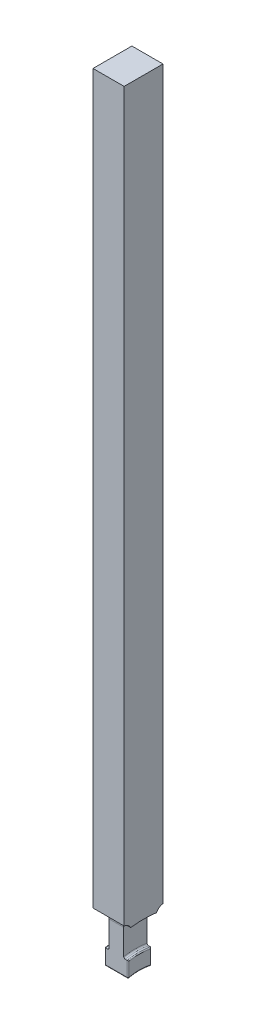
ISO-10303-21;
HEADER;
FILE_DESCRIPTION(('STEP AP214'),'2;1');
FILE_NAME('part.step','',(''),(''),'','','');
FILE_SCHEMA(('AUTOMOTIVE_DESIGN { 1 0 10303 214 1 1 1 1 }'));
ENDSEC;
DATA;
#1=APPLICATION_CONTEXT('core data for automotive mechanical design processes');
#2=APPLICATION_PROTOCOL_DEFINITION('international standard','automotive_design',2000,#1);
#3=PRODUCT_CONTEXT('',#1,'mechanical');
#4=PRODUCT('Part','Part','',(#3));
#5=PRODUCT_RELATED_PRODUCT_CATEGORY('part','',(#4));
#6=PRODUCT_DEFINITION_FORMATION('','',#4);
#7=PRODUCT_DEFINITION_CONTEXT('part definition',#1,'design');
#8=PRODUCT_DEFINITION('design','',#6,#7);
#9=PRODUCT_DEFINITION_SHAPE('','',#8);
#10=(LENGTH_UNIT() NAMED_UNIT(*) SI_UNIT(.MILLI.,.METRE.));
#11=(NAMED_UNIT(*) PLANE_ANGLE_UNIT() SI_UNIT($,.RADIAN.));
#12=(NAMED_UNIT(*) SI_UNIT($,.STERADIAN.) SOLID_ANGLE_UNIT());
#13=UNCERTAINTY_MEASURE_WITH_UNIT(LENGTH_MEASURE(1.E-05),#10,'distance_accuracy_value','');
#14=(GEOMETRIC_REPRESENTATION_CONTEXT(3) GLOBAL_UNCERTAINTY_ASSIGNED_CONTEXT((#13)) GLOBAL_UNIT_ASSIGNED_CONTEXT((#10,
#11,#12)) REPRESENTATION_CONTEXT('',''));
#15=CARTESIAN_POINT('',(0.,0.,0.));
#16=DIRECTION('',(0.,0.,1.));
#17=DIRECTION('',(1.,0.,0.));
#18=AXIS2_PLACEMENT_3D('',#15,#16,#17);
#19=CARTESIAN_POINT('',(4.,212.,4.99999999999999));
#20=DIRECTION('',(0.,0.,-1.));
#21=DIRECTION('',(0.,1.,0.));
#22=AXIS2_PLACEMENT_3D('',#19,#20,#21);
#23=PLANE('',#22);
#24=DIRECTION('',(0.,-1.,0.));
#25=VECTOR('',#24,1.);
#26=CARTESIAN_POINT('',(-4.,212.,4.99999999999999));
#27=LINE('',#26,#25);
#28=CARTESIAN_POINT('',(-4.,212.,4.99999999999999));
#29=VERTEX_POINT('',#28);
#30=CARTESIAN_POINT('',(-4.00000000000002,24.9683286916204,4.99999999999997));
#31=VERTEX_POINT('',#30);
#32=EDGE_CURVE('E247',#29,#31,#27,.T.);
#33=ORIENTED_EDGE('',*,*,#32,.T.);
#34=DIRECTION('',(1.,0.,0.));
#35=VECTOR('',#34,1.);
#36=CARTESIAN_POINT('',(-4.00000000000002,24.9683286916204,4.99999999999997));
#37=LINE('',#36,#35);
#38=CARTESIAN_POINT('',(4.00000000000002,24.9683286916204,4.99999999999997));
#39=VERTEX_POINT('',#38);
#40=EDGE_CURVE('E382',#31,#39,#37,.T.);
#41=ORIENTED_EDGE('',*,*,#40,.T.);
#42=DIRECTION('',(0.,-1.,0.));
#43=VECTOR('',#42,1.);
#44=CARTESIAN_POINT('',(4.,212.,4.99999999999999));
#45=LINE('',#44,#43);
#46=CARTESIAN_POINT('',(4.,212.,4.99999999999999));
#47=VERTEX_POINT('',#46);
#48=EDGE_CURVE('E237',#47,#39,#45,.T.);
#49=ORIENTED_EDGE('',*,*,#48,.F.);
#50=DIRECTION('',(-1.,0.,0.));
#51=VECTOR('',#50,1.);
#52=CARTESIAN_POINT('',(4.,212.,4.99999999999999));
#53=LINE('',#52,#51);
#54=EDGE_CURVE('E228',#47,#29,#53,.T.);
#55=ORIENTED_EDGE('',*,*,#54,.T.);
#56=EDGE_LOOP('',(#33,#41,#49,#55));
#57=FACE_BOUND('',#56,.T.);
#58=ADVANCED_FACE('F37',(#57),#23,.F.);
#59=CARTESIAN_POINT('',(4.,212.,-5.));
#60=DIRECTION('',(0.,0.,1.));
#61=DIRECTION('',(0.,-1.,0.));
#62=AXIS2_PLACEMENT_3D('',#59,#60,#61);
#63=PLANE('',#62);
#64=DIRECTION('',(0.,1.,0.));
#65=VECTOR('',#64,1.);
#66=CARTESIAN_POINT('',(4.,212.,-5.));
#67=LINE('',#66,#65);
#68=CARTESIAN_POINT('',(4.00000000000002,24.9683286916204,-5.00000000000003));
#69=VERTEX_POINT('',#68);
#70=CARTESIAN_POINT('',(4.,212.,-5.));
#71=VERTEX_POINT('',#70);
#72=EDGE_CURVE('E259',#69,#71,#67,.T.);
#73=ORIENTED_EDGE('',*,*,#72,.F.);
#74=DIRECTION('',(1.,0.,0.));
#75=VECTOR('',#74,1.);
#76=CARTESIAN_POINT('',(-4.00000000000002,24.9683286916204,-5.00000000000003));
#77=LINE('',#76,#75);
#78=CARTESIAN_POINT('',(-4.00000000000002,24.9683286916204,-5.00000000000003));
#79=VERTEX_POINT('',#78);
#80=EDGE_CURVE('E413',#69,#79,#77,.F.);
#81=ORIENTED_EDGE('',*,*,#80,.T.);
#82=DIRECTION('',(0.,1.,0.));
#83=VECTOR('',#82,1.);
#84=CARTESIAN_POINT('',(-4.,212.,-5.));
#85=LINE('',#84,#83);
#86=CARTESIAN_POINT('',(-4.,212.,-5.));
#87=VERTEX_POINT('',#86);
#88=EDGE_CURVE('E257',#79,#87,#85,.T.);
#89=ORIENTED_EDGE('',*,*,#88,.T.);
#90=DIRECTION('',(-1.,0.,0.));
#91=VECTOR('',#90,1.);
#92=CARTESIAN_POINT('',(4.,212.,-5.));
#93=LINE('',#92,#91);
#94=EDGE_CURVE('E260',#71,#87,#93,.T.);
#95=ORIENTED_EDGE('',*,*,#94,.F.);
#96=EDGE_LOOP('',(#73,#81,#89,#95));
#97=FACE_BOUND('',#96,.T.);
#98=ADVANCED_FACE('F374',(#97),#63,.F.);
#99=CARTESIAN_POINT('',(-4.,0.,0.));
#100=DIRECTION('',(-1.,0.,0.));
#101=DIRECTION('',(0.,0.,1.));
#102=AXIS2_PLACEMENT_3D('',#99,#100,#101);
#103=PLANE('',#102);
#104=CARTESIAN_POINT('',(-4.00000000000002,22.6124,-5.3876));
#105=DIRECTION('',(1.,0.,0.));
#106=DIRECTION('',(0.,0.,1.));
#107=AXIS2_PLACEMENT_3D('',#104,#105,#106);
#108=CIRCLE('',#107,2.3876);
#109=CARTESIAN_POINT('',(-4.00000000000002,23.7719741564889,-3.3004915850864));
#110=VERTEX_POINT('',#109);
#111=EDGE_CURVE('E439',#79,#110,#108,.T.);
#112=ORIENTED_EDGE('',*,*,#111,.T.);
#113=CARTESIAN_POINT('',(-4.00000000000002,0.,0.));
#114=DIRECTION('',(-1.,0.,0.));
#115=DIRECTION('',(0.,0.,1.));
#116=AXIS2_PLACEMENT_3D('',#113,#114,#115);
#117=CIRCLE('',#116,24.);
#118=CARTESIAN_POINT('',(-4.00000000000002,23.7719741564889,3.3004915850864));
#119=VERTEX_POINT('',#118);
#120=EDGE_CURVE('E244',#119,#110,#117,.T.);
#121=ORIENTED_EDGE('',*,*,#120,.F.);
#122=CARTESIAN_POINT('',(-4.00000000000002,22.6124,5.3876));
#123=DIRECTION('',(1.,0.,0.));
#124=DIRECTION('',(0.,0.,-1.));
#125=AXIS2_PLACEMENT_3D('',#122,#123,#124);
#126=CIRCLE('',#125,2.3876);
#127=EDGE_CURVE('E238',#119,#31,#126,.T.);
#128=ORIENTED_EDGE('',*,*,#127,.T.);
#129=ORIENTED_EDGE('',*,*,#32,.F.);
#130=DIRECTION('',(0.,0.,1.));
#131=VECTOR('',#130,1.);
#132=CARTESIAN_POINT('',(-4.,212.,4.99999999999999));
#133=LINE('',#132,#131);
#134=EDGE_CURVE('E243',#87,#29,#133,.T.);
#135=ORIENTED_EDGE('',*,*,#134,.F.);
#136=ORIENTED_EDGE('',*,*,#88,.F.);
#137=EDGE_LOOP('',(#112,#121,#128,#129,#135,#136));
#138=FACE_BOUND('',#137,.T.);
#139=ADVANCED_FACE('F371',(#138),#103,.T.);
#140=CARTESIAN_POINT('',(4.,212.,4.99999999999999));
#141=DIRECTION('',(0.,-1.,0.));
#142=DIRECTION('',(0.,0.,-1.));
#143=AXIS2_PLACEMENT_3D('',#140,#141,#142);
#144=PLANE('',#143);
#145=ORIENTED_EDGE('',*,*,#134,.T.);
#146=ORIENTED_EDGE('',*,*,#54,.F.);
#147=DIRECTION('',(0.,0.,1.));
#148=VECTOR('',#147,1.);
#149=CARTESIAN_POINT('',(4.,212.,4.99999999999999));
#150=LINE('',#149,#148);
#151=EDGE_CURVE('E255',#71,#47,#150,.T.);
#152=ORIENTED_EDGE('',*,*,#151,.F.);
#153=ORIENTED_EDGE('',*,*,#94,.T.);
#154=EDGE_LOOP('',(#145,#146,#152,#153));
#155=FACE_BOUND('',#154,.T.);
#156=ADVANCED_FACE('F311',(#155),#144,.F.);
#157=CARTESIAN_POINT('',(4.,0.,0.));
#158=DIRECTION('',(-1.,0.,0.));
#159=DIRECTION('',(0.,0.,1.));
#160=AXIS2_PLACEMENT_3D('',#157,#158,#159);
#161=PLANE('',#160);
#162=CARTESIAN_POINT('',(4.00000000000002,0.,0.));
#163=DIRECTION('',(-1.,0.,0.));
#164=DIRECTION('',(0.,0.,1.));
#165=AXIS2_PLACEMENT_3D('',#162,#163,#164);
#166=CIRCLE('',#165,24.);
#167=CARTESIAN_POINT('',(4.00000000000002,23.7719741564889,3.3004915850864));
#168=VERTEX_POINT('',#167);
#169=CARTESIAN_POINT('',(4.00000000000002,23.7719741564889,-3.3004915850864));
#170=VERTEX_POINT('',#169);
#171=EDGE_CURVE('E235',#168,#170,#166,.T.);
#172=ORIENTED_EDGE('',*,*,#171,.T.);
#173=CARTESIAN_POINT('',(4.00000000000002,22.6124,-5.3876));
#174=DIRECTION('',(1.,0.,0.));
#175=DIRECTION('',(0.,0.,1.));
#176=AXIS2_PLACEMENT_3D('',#173,#174,#175);
#177=CIRCLE('',#176,2.3876);
#178=EDGE_CURVE('E394',#69,#170,#177,.T.);
#179=ORIENTED_EDGE('',*,*,#178,.F.);
#180=ORIENTED_EDGE('',*,*,#72,.T.);
#181=ORIENTED_EDGE('',*,*,#151,.T.);
#182=ORIENTED_EDGE('',*,*,#48,.T.);
#183=CARTESIAN_POINT('',(4.00000000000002,22.6124,5.3876));
#184=DIRECTION('',(1.,0.,0.));
#185=DIRECTION('',(0.,0.,-1.));
#186=AXIS2_PLACEMENT_3D('',#183,#184,#185);
#187=CIRCLE('',#186,2.3876);
#188=EDGE_CURVE('E218',#168,#39,#187,.T.);
#189=ORIENTED_EDGE('',*,*,#188,.F.);
#190=EDGE_LOOP('',(#172,#179,#180,#181,#182,#189));
#191=FACE_BOUND('',#190,.T.);
#192=ADVANCED_FACE('F233',(#191),#161,.F.);
#193=CARTESIAN_POINT('',(-4.,0.,0.));
#194=DIRECTION('',(1.,0.,0.));
#195=DIRECTION('',(0.,0.,-1.));
#196=AXIS2_PLACEMENT_3D('',#193,#194,#195);
#197=CYLINDRICAL_SURFACE('',#196,12.);
#198=CARTESIAN_POINT('',(-2.746,0.,0.));
#199=DIRECTION('',(1.,0.,0.));
#200=DIRECTION('',(0.,1.,0.));
#201=AXIS2_PLACEMENT_3D('',#198,#199,#200);
#202=CIRCLE('',#201,12.);
#203=CARTESIAN_POINT('',(-2.746,11.6948211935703,2.68908111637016));
#204=VERTEX_POINT('',#203);
#205=CARTESIAN_POINT('',(-2.746,11.6948211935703,-2.68908111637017));
#206=VERTEX_POINT('',#205);
#207=EDGE_CURVE('E611',#204,#206,#202,.F.);
#208=ORIENTED_EDGE('',*,*,#207,.T.);
#209=DIRECTION('',(1.,0.,0.));
#210=VECTOR('',#209,1.);
#211=CARTESIAN_POINT('',(-4.,11.6948211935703,-2.68908111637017));
#212=LINE('',#211,#210);
#213=CARTESIAN_POINT('',(2.746,11.6948211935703,-2.68908111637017));
#214=VERTEX_POINT('',#213);
#215=EDGE_CURVE('E606',#206,#214,#212,.T.);
#216=ORIENTED_EDGE('',*,*,#215,.T.);
#217=CARTESIAN_POINT('',(2.746,0.,0.));
#218=DIRECTION('',(-1.,0.,0.));
#219=DIRECTION('',(0.,-1.,0.));
#220=AXIS2_PLACEMENT_3D('',#217,#218,#219);
#221=CIRCLE('',#220,12.);
#222=CARTESIAN_POINT('',(2.746,11.6948211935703,2.68908111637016));
#223=VERTEX_POINT('',#222);
#224=EDGE_CURVE('E608',#214,#223,#221,.F.);
#225=ORIENTED_EDGE('',*,*,#224,.T.);
#226=DIRECTION('',(1.,0.,0.));
#227=VECTOR('',#226,1.);
#228=CARTESIAN_POINT('',(-4.,11.6948211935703,2.68908111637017));
#229=LINE('',#228,#227);
#230=EDGE_CURVE('E613',#223,#204,#229,.F.);
#231=ORIENTED_EDGE('',*,*,#230,.T.);
#232=EDGE_LOOP('',(#208,#216,#225,#231));
#233=FACE_BOUND('',#232,.T.);
#234=ADVANCED_FACE('F358',(#233),#197,.F.);
#235=CARTESIAN_POINT('',(-1.905,16.,0.));
#236=DIRECTION('',(-1.,0.,0.));
#237=DIRECTION('',(0.,0.,1.));
#238=AXIS2_PLACEMENT_3D('',#235,#236,#237);
#239=PLANE('',#238);
#240=DIRECTION('',(0.,1.,0.));
#241=VECTOR('',#240,1.);
#242=CARTESIAN_POINT('',(-1.905,16.,-3.));
#243=LINE('',#242,#241);
#244=CARTESIAN_POINT('',(-1.905,16.1039486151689,-3.));
#245=VERTEX_POINT('',#244);
#246=CARTESIAN_POINT('',(-1.905,22.6124,-3.));
#247=VERTEX_POINT('',#246);
#248=EDGE_CURVE('E250',#245,#247,#243,.T.);
#249=ORIENTED_EDGE('',*,*,#248,.F.);
#250=CARTESIAN_POINT('',(-1.905,0.,0.));
#251=DIRECTION('',(-1.,0.,0.));
#252=DIRECTION('',(0.,0.,1.));
#253=AXIS2_PLACEMENT_3D('',#250,#251,#252);
#254=CIRCLE('',#253,16.381);
#255=CARTESIAN_POINT('',(-1.905,16.1039486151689,3.));
#256=VERTEX_POINT('',#255);
#257=EDGE_CURVE('E471',#245,#256,#254,.F.);
#258=ORIENTED_EDGE('',*,*,#257,.T.);
#259=DIRECTION('',(0.,-1.,0.));
#260=VECTOR('',#259,1.);
#261=CARTESIAN_POINT('',(-1.905,16.,3.));
#262=LINE('',#261,#260);
#263=CARTESIAN_POINT('',(-1.905,22.6124,3.));
#264=VERTEX_POINT('',#263);
#265=EDGE_CURVE('E421',#264,#256,#262,.T.);
#266=ORIENTED_EDGE('',*,*,#265,.F.);
#267=CARTESIAN_POINT('',(-1.905,22.6124,5.3876));
#268=DIRECTION('',(-1.,0.,0.));
#269=DIRECTION('',(0.,0.,1.));
#270=AXIS2_PLACEMENT_3D('',#267,#268,#269);
#271=CIRCLE('',#270,2.3876);
#272=CARTESIAN_POINT('',(-1.905,23.0385151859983,3.03833211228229));
#273=VERTEX_POINT('',#272);
#274=EDGE_CURVE('E403',#273,#264,#271,.T.);
#275=ORIENTED_EDGE('',*,*,#274,.F.);
#276=CARTESIAN_POINT('',(-1.905,0.,0.));
#277=DIRECTION('',(-1.,0.,0.));
#278=DIRECTION('',(0.,0.,1.));
#279=AXIS2_PLACEMENT_3D('',#276,#277,#278);
#280=CIRCLE('',#279,23.238);
#281=CARTESIAN_POINT('',(-1.905,23.0385151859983,-3.03833211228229));
#282=VERTEX_POINT('',#281);
#283=EDGE_CURVE('E275',#273,#282,#280,.T.);
#284=ORIENTED_EDGE('',*,*,#283,.T.);
#285=CARTESIAN_POINT('',(-1.905,22.6124,-5.3876));
#286=DIRECTION('',(-1.,0.,0.));
#287=DIRECTION('',(0.,0.,1.));
#288=AXIS2_PLACEMENT_3D('',#285,#286,#287);
#289=CIRCLE('',#288,2.3876);
#290=EDGE_CURVE('E410',#247,#282,#289,.T.);
#291=ORIENTED_EDGE('',*,*,#290,.F.);
#292=EDGE_LOOP('',(#249,#258,#266,#275,#284,#291));
#293=FACE_BOUND('',#292,.T.);
#294=ADVANCED_FACE('F354',(#293),#239,.T.);
#295=CARTESIAN_POINT('',(-8.84822894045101,0.,0.));
#296=DIRECTION('',(-1.,0.,0.));
#297=DIRECTION('',(0.,0.,1.));
#298=AXIS2_PLACEMENT_3D('',#295,#296,#297);
#299=CYLINDRICAL_SURFACE('',#298,24.);
#300=DIRECTION('',(1.,0.,0.));
#301=VECTOR('',#300,1.);
#302=CARTESIAN_POINT('',(-2.95250000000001,23.7719741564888,-3.3004915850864));
#303=LINE('',#302,#301);
#304=CARTESIAN_POINT('',(-2.667,23.7719741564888,-3.3004915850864));
#305=VERTEX_POINT('',#304);
#306=EDGE_CURVE('E408',#305,#110,#303,.F.);
#307=ORIENTED_EDGE('',*,*,#306,.F.);
#308=CARTESIAN_POINT('',(-2.667,0.,0.));
#309=DIRECTION('',(-1.,0.,0.));
#310=DIRECTION('',(0.,0.,1.));
#311=AXIS2_PLACEMENT_3D('',#308,#309,#310);
#312=CIRCLE('',#311,24.);
#313=CARTESIAN_POINT('',(-2.667,23.7719741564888,3.3004915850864));
#314=VERTEX_POINT('',#313);
#315=EDGE_CURVE('E278',#305,#314,#312,.F.);
#316=ORIENTED_EDGE('',*,*,#315,.T.);
#317=DIRECTION('',(1.,0.,0.));
#318=VECTOR('',#317,1.);
#319=CARTESIAN_POINT('',(-2.95250000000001,23.7719741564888,3.3004915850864));
#320=LINE('',#319,#318);
#321=EDGE_CURVE('E400',#119,#314,#320,.T.);
#322=ORIENTED_EDGE('',*,*,#321,.F.);
#323=ORIENTED_EDGE('',*,*,#120,.T.);
#324=EDGE_LOOP('',(#307,#316,#322,#323));
#325=FACE_BOUND('',#324,.T.);
#326=ADVANCED_FACE('F357',(#325),#299,.F.);
#327=CARTESIAN_POINT('',(-8.84822894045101,0.,0.));
#328=DIRECTION('',(-1.,0.,0.));
#329=DIRECTION('',(0.,0.,1.));
#330=AXIS2_PLACEMENT_3D('',#327,#328,#329);
#331=CYLINDRICAL_SURFACE('',#330,16.);
#332=DIRECTION('',(-1.,0.,0.));
#333=VECTOR('',#332,1.);
#334=CARTESIAN_POINT('',(-8.84822894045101,15.7162336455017,-3.));
#335=LINE('',#334,#333);
#336=CARTESIAN_POINT('',(-2.746,15.7162336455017,-3.));
#337=VERTEX_POINT('',#336);
#338=CARTESIAN_POINT('',(-2.286,15.7162336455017,-3.));
#339=VERTEX_POINT('',#338);
#340=EDGE_CURVE('E426',#337,#339,#335,.F.);
#341=ORIENTED_EDGE('',*,*,#340,.F.);
#342=CARTESIAN_POINT('',(-2.746,0.,0.));
#343=DIRECTION('',(1.,0.,0.));
#344=DIRECTION('',(0.,1.,0.));
#345=AXIS2_PLACEMENT_3D('',#342,#343,#344);
#346=CIRCLE('',#345,16.);
#347=CARTESIAN_POINT('',(-2.746,15.7162336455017,3.));
#348=VERTEX_POINT('',#347);
#349=EDGE_CURVE('E11',#337,#348,#346,.T.);
#350=ORIENTED_EDGE('',*,*,#349,.T.);
#351=DIRECTION('',(-1.,0.,0.));
#352=VECTOR('',#351,1.);
#353=CARTESIAN_POINT('',(-8.84822894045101,15.7162336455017,3.));
#354=LINE('',#353,#352);
#355=CARTESIAN_POINT('',(-2.286,15.7162336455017,3.));
#356=VERTEX_POINT('',#355);
#357=EDGE_CURVE('E418',#356,#348,#354,.T.);
#358=ORIENTED_EDGE('',*,*,#357,.F.);
#359=CARTESIAN_POINT('',(-2.286,0.,0.));
#360=DIRECTION('',(-1.,0.,0.));
#361=DIRECTION('',(0.,0.,1.));
#362=AXIS2_PLACEMENT_3D('',#359,#360,#361);
#363=CIRCLE('',#362,16.);
#364=EDGE_CURVE('E333',#356,#339,#363,.T.);
#365=ORIENTED_EDGE('',*,*,#364,.T.);
#366=EDGE_LOOP('',(#341,#350,#358,#365));
#367=FACE_BOUND('',#366,.T.);
#368=ADVANCED_FACE('F349',(#367),#331,.T.);
#369=CARTESIAN_POINT('',(1.905,16.,0.));
#370=DIRECTION('',(1.,0.,0.));
#371=DIRECTION('',(0.,0.,-1.));
#372=AXIS2_PLACEMENT_3D('',#369,#370,#371);
#373=PLANE('',#372);
#374=DIRECTION('',(0.,1.,0.));
#375=VECTOR('',#374,1.);
#376=CARTESIAN_POINT('',(1.905,16.,3.));
#377=LINE('',#376,#375);
#378=CARTESIAN_POINT('',(1.905,16.1039486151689,3.));
#379=VERTEX_POINT('',#378);
#380=CARTESIAN_POINT('',(1.905,22.6124,3.));
#381=VERTEX_POINT('',#380);
#382=EDGE_CURVE('E416',#379,#381,#377,.T.);
#383=ORIENTED_EDGE('',*,*,#382,.F.);
#384=CARTESIAN_POINT('',(1.905,0.,0.));
#385=DIRECTION('',(1.,0.,0.));
#386=DIRECTION('',(0.,0.,-1.));
#387=AXIS2_PLACEMENT_3D('',#384,#385,#386);
#388=CIRCLE('',#387,16.381);
#389=CARTESIAN_POINT('',(1.905,16.1039486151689,-3.));
#390=VERTEX_POINT('',#389);
#391=EDGE_CURVE('E452',#379,#390,#388,.F.);
#392=ORIENTED_EDGE('',*,*,#391,.T.);
#393=DIRECTION('',(0.,-1.,0.));
#394=VECTOR('',#393,1.);
#395=CARTESIAN_POINT('',(1.905,16.,-3.));
#396=LINE('',#395,#394);
#397=CARTESIAN_POINT('',(1.905,22.6124,-3.));
#398=VERTEX_POINT('',#397);
#399=EDGE_CURVE('E424',#398,#390,#396,.T.);
#400=ORIENTED_EDGE('',*,*,#399,.F.);
#401=CARTESIAN_POINT('',(1.905,22.6124,-5.3876));
#402=DIRECTION('',(1.,0.,0.));
#403=DIRECTION('',(0.,0.,-1.));
#404=AXIS2_PLACEMENT_3D('',#401,#402,#403);
#405=CIRCLE('',#404,2.3876);
#406=CARTESIAN_POINT('',(1.905,23.0385151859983,-3.03833211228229));
#407=VERTEX_POINT('',#406);
#408=EDGE_CURVE('E406',#407,#398,#405,.T.);
#409=ORIENTED_EDGE('',*,*,#408,.F.);
#410=CARTESIAN_POINT('',(1.905,0.,0.));
#411=DIRECTION('',(1.,0.,0.));
#412=DIRECTION('',(0.,0.,-1.));
#413=AXIS2_PLACEMENT_3D('',#410,#411,#412);
#414=CIRCLE('',#413,23.238);
#415=CARTESIAN_POINT('',(1.905,23.0385151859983,3.03833211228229));
#416=VERTEX_POINT('',#415);
#417=EDGE_CURVE('E282',#407,#416,#414,.T.);
#418=ORIENTED_EDGE('',*,*,#417,.T.);
#419=CARTESIAN_POINT('',(1.905,22.6124,5.3876));
#420=DIRECTION('',(1.,0.,0.));
#421=DIRECTION('',(0.,0.,-1.));
#422=AXIS2_PLACEMENT_3D('',#419,#420,#421);
#423=CIRCLE('',#422,2.3876);
#424=EDGE_CURVE('E398',#381,#416,#423,.T.);
#425=ORIENTED_EDGE('',*,*,#424,.F.);
#426=EDGE_LOOP('',(#383,#392,#400,#409,#418,#425));
#427=FACE_BOUND('',#426,.T.);
#428=ADVANCED_FACE('F346',(#427),#373,.T.);
#429=CARTESIAN_POINT('',(-8.84822894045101,0.,0.));
#430=DIRECTION('',(-1.,0.,0.));
#431=DIRECTION('',(0.,0.,1.));
#432=AXIS2_PLACEMENT_3D('',#429,#430,#431);
#433=CYLINDRICAL_SURFACE('',#432,16.);
#434=DIRECTION('',(-1.,0.,0.));
#435=VECTOR('',#434,1.);
#436=CARTESIAN_POINT('',(-8.84822894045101,15.7162336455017,3.));
#437=LINE('',#436,#435);
#438=CARTESIAN_POINT('',(2.746,15.7162336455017,3.));
#439=VERTEX_POINT('',#438);
#440=CARTESIAN_POINT('',(2.286,15.7162336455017,3.));
#441=VERTEX_POINT('',#440);
#442=EDGE_CURVE('E270',#439,#441,#437,.T.);
#443=ORIENTED_EDGE('',*,*,#442,.F.);
#444=CARTESIAN_POINT('',(2.746,0.,0.));
#445=DIRECTION('',(-1.,0.,0.));
#446=DIRECTION('',(0.,-1.,0.));
#447=AXIS2_PLACEMENT_3D('',#444,#445,#446);
#448=CIRCLE('',#447,16.);
#449=CARTESIAN_POINT('',(2.746,15.7162336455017,-3.));
#450=VERTEX_POINT('',#449);
#451=EDGE_CURVE('E467',#439,#450,#448,.T.);
#452=ORIENTED_EDGE('',*,*,#451,.T.);
#453=DIRECTION('',(-1.,0.,0.));
#454=VECTOR('',#453,1.);
#455=CARTESIAN_POINT('',(-8.84822894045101,15.7162336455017,-3.));
#456=LINE('',#455,#454);
#457=CARTESIAN_POINT('',(2.286,15.7162336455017,-3.));
#458=VERTEX_POINT('',#457);
#459=EDGE_CURVE('E272',#458,#450,#456,.F.);
#460=ORIENTED_EDGE('',*,*,#459,.F.);
#461=CARTESIAN_POINT('',(2.286,0.,0.));
#462=DIRECTION('',(1.,0.,0.));
#463=DIRECTION('',(0.,0.,-1.));
#464=AXIS2_PLACEMENT_3D('',#461,#462,#463);
#465=CIRCLE('',#464,16.);
#466=EDGE_CURVE('E464',#458,#441,#465,.T.);
#467=ORIENTED_EDGE('',*,*,#466,.T.);
#468=EDGE_LOOP('',(#443,#452,#460,#467));
#469=FACE_BOUND('',#468,.T.);
#470=ADVANCED_FACE('F345',(#469),#433,.T.);
#471=CARTESIAN_POINT('',(-8.84822894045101,0.,0.));
#472=DIRECTION('',(-1.,0.,0.));
#473=DIRECTION('',(0.,0.,1.));
#474=AXIS2_PLACEMENT_3D('',#471,#472,#473);
#475=CYLINDRICAL_SURFACE('',#474,24.);
#476=DIRECTION('',(1.,0.,0.));
#477=VECTOR('',#476,1.);
#478=CARTESIAN_POINT('',(2.95250000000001,23.7719741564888,3.3004915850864));
#479=LINE('',#478,#477);
#480=CARTESIAN_POINT('',(2.667,23.7719741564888,3.3004915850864));
#481=VERTEX_POINT('',#480);
#482=EDGE_CURVE('E215',#481,#168,#479,.T.);
#483=ORIENTED_EDGE('',*,*,#482,.F.);
#484=CARTESIAN_POINT('',(2.667,0.,0.));
#485=DIRECTION('',(1.,0.,0.));
#486=DIRECTION('',(0.,0.,-1.));
#487=AXIS2_PLACEMENT_3D('',#484,#485,#486);
#488=CIRCLE('',#487,24.);
#489=CARTESIAN_POINT('',(2.667,23.7719741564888,-3.3004915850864));
#490=VERTEX_POINT('',#489);
#491=EDGE_CURVE('E280',#481,#490,#488,.F.);
#492=ORIENTED_EDGE('',*,*,#491,.T.);
#493=DIRECTION('',(1.,0.,0.));
#494=VECTOR('',#493,1.);
#495=CARTESIAN_POINT('',(2.95250000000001,23.7719741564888,-3.3004915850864));
#496=LINE('',#495,#494);
#497=EDGE_CURVE('E227',#170,#490,#496,.F.);
#498=ORIENTED_EDGE('',*,*,#497,.F.);
#499=ORIENTED_EDGE('',*,*,#171,.F.);
#500=EDGE_LOOP('',(#483,#492,#498,#499));
#501=FACE_BOUND('',#500,.T.);
#502=ADVANCED_FACE('F241',(#501),#475,.F.);
#503=CARTESIAN_POINT('',(-4.00000000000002,0.,3.));
#504=DIRECTION('',(0.,0.,-1.));
#505=DIRECTION('',(0.,1.,0.));
#506=AXIS2_PLACEMENT_3D('',#503,#504,#505);
#507=PLANE('',#506);
#508=DIRECTION('',(1.,0.,0.));
#509=VECTOR('',#508,1.);
#510=CARTESIAN_POINT('',(-4.00000000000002,11.9423615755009,3.));
#511=LINE('',#510,#509);
#512=CARTESIAN_POINT('',(-2.746,11.9423615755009,3.));
#513=VERTEX_POINT('',#512);
#514=CARTESIAN_POINT('',(2.746,11.9423615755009,3.));
#515=VERTEX_POINT('',#514);
#516=EDGE_CURVE('E604',#513,#515,#511,.T.);
#517=ORIENTED_EDGE('',*,*,#516,.T.);
#518=DIRECTION('',(0.,1.,0.));
#519=VECTOR('',#518,1.);
#520=CARTESIAN_POINT('',(2.746,0.,3.));
#521=LINE('',#520,#519);
#522=EDGE_CURVE('E601',#515,#439,#521,.T.);
#523=ORIENTED_EDGE('',*,*,#522,.T.);
#524=ORIENTED_EDGE('',*,*,#442,.T.);
#525=CARTESIAN_POINT('',(2.286,15.7162336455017,3.));
#526=CARTESIAN_POINT('',(2.26483852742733,15.7162138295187,3.));
#527=CARTESIAN_POINT('',(2.24368479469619,15.7180272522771,3.));
#528=CARTESIAN_POINT('',(2.20200688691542,15.7251715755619,3.));
#529=CARTESIAN_POINT('',(2.18148193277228,15.7304979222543,3.));
#530=CARTESIAN_POINT('',(2.14161183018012,15.7445219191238,3.));
#531=CARTESIAN_POINT('',(2.12226704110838,15.7532205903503,3.));
#532=CARTESIAN_POINT('',(2.08529777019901,15.7737154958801,3.));
#533=CARTESIAN_POINT('',(2.06767323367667,15.7855116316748,3.));
#534=CARTESIAN_POINT('',(2.03448598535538,15.8119557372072,3.));
#535=CARTESIAN_POINT('',(2.01894051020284,15.8266253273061,3.));
#536=CARTESIAN_POINT('',(1.99048101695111,15.8583304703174,3.));
#537=CARTESIAN_POINT('',(1.97756759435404,15.875366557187,3.));
#538=CARTESIAN_POINT('',(1.95451065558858,15.9116241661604,3.));
#539=CARTESIAN_POINT('',(1.94441753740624,15.9308777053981,3.));
#540=CARTESIAN_POINT('',(1.92755440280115,15.9707855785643,3.));
#541=CARTESIAN_POINT('',(1.92078322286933,15.9914394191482,3.));
#542=CARTESIAN_POINT('',(1.91218275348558,16.0274736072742,3.));
#543=CARTESIAN_POINT('',(1.90949097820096,16.0426541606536,3.));
#544=CARTESIAN_POINT('',(1.90589964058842,16.0732042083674,3.));
#545=CARTESIAN_POINT('',(1.90499757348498,16.088573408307,3.));
#546=CARTESIAN_POINT('',(1.905,16.1039486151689,3.));
#547=B_SPLINE_CURVE_WITH_KNOTS('',3,(#525,#526,#527,#528,#529,#530,#531,#532,#533,#534,#535,
#536,#537,#538,#539,#540,#541,#542,#543,#544,#545,#546),.UNSPECIFIED.,.F.,.F.,(4,2,2,2,2,2,2,2,
2,2,4),(0.,0.0633953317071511,0.126708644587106,0.190041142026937,0.253371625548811,
0.317198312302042,0.381039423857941,0.445957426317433,0.510852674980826,0.557004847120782,
0.603092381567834),.UNSPECIFIED.);
#548=EDGE_CURVE('E459',#441,#379,#547,.T.);
#549=ORIENTED_EDGE('',*,*,#548,.T.);
#550=ORIENTED_EDGE('',*,*,#382,.T.);
#551=DIRECTION('',(1.,0.,0.));
#552=VECTOR('',#551,1.);
#553=CARTESIAN_POINT('',(-4.00000000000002,22.6124,3.));
#554=LINE('',#553,#552);
#555=EDGE_CURVE('E391',#264,#381,#554,.T.);
#556=ORIENTED_EDGE('',*,*,#555,.F.);
#557=ORIENTED_EDGE('',*,*,#265,.T.);
#558=CARTESIAN_POINT('',(-1.905,16.1039486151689,3.));
#559=CARTESIAN_POINT('',(-1.90498313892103,16.0818581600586,3.));
#560=CARTESIAN_POINT('',(-1.90685583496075,16.0597712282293,3.));
#561=CARTESIAN_POINT('',(-1.91425675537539,16.0162247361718,3.));
#562=CARTESIAN_POINT('',(-1.91978390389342,15.9947649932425,3.));
#563=CARTESIAN_POINT('',(-1.93437489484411,15.9530662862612,3.));
#564=CARTESIAN_POINT('',(-1.94344097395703,15.9328281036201,3.));
#565=CARTESIAN_POINT('',(-1.96486395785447,15.8941821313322,3.));
#566=CARTESIAN_POINT('',(-1.9772198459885,15.8757737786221,3.));
#567=CARTESIAN_POINT('',(-2.00478592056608,15.8414646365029,3.));
#568=CARTESIAN_POINT('',(-2.01997366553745,15.8255458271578,3.));
#569=CARTESIAN_POINT('',(-2.05285036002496,15.7965326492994,3.));
#570=CARTESIAN_POINT('',(-2.07053969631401,15.7834387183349,3.));
#571=CARTESIAN_POINT('',(-2.10760244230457,15.7606829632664,3.));
#572=CARTESIAN_POINT('',(-2.12694358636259,15.7509685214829,3.));
#573=CARTESIAN_POINT('',(-2.16699486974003,15.734991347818,3.));
#574=CARTESIAN_POINT('',(-2.18770383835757,15.7287257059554,3.));
#575=CARTESIAN_POINT('',(-2.22147725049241,15.7216077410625,3.));
#576=CARTESIAN_POINT('',(-2.23430798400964,15.7195936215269,3.));
#577=CARTESIAN_POINT('',(-2.26009046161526,15.7169069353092,3.));
#578=CARTESIAN_POINT('',(-2.27304200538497,15.7162324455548,3.));
#579=CARTESIAN_POINT('',(-2.28599999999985,15.716233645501,3.));
#580=B_SPLINE_CURVE_WITH_KNOTS('',3,(#558,#559,#560,#561,#562,#563,#564,#565,#566,#567,#568,
#569,#570,#571,#572,#573,#574,#575,#576,#577,#578,#579),.UNSPECIFIED.,.F.,.F.,(4,2,2,2,2,2,2,2,
2,2,4),(0.,0.0661875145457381,0.132355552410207,0.198565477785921,0.264754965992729,
0.330440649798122,0.396136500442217,0.460758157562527,0.525325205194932,0.564224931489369,
0.603068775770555),.UNSPECIFIED.);
#581=EDGE_CURVE('E460',#256,#356,#580,.T.);
#582=ORIENTED_EDGE('',*,*,#581,.T.);
#583=ORIENTED_EDGE('',*,*,#357,.T.);
#584=DIRECTION('',(0.,-1.,0.));
#585=VECTOR('',#584,1.);
#586=CARTESIAN_POINT('',(-2.746,0.,3.));
#587=LINE('',#586,#585);
#588=EDGE_CURVE('E594',#348,#513,#587,.T.);
#589=ORIENTED_EDGE('',*,*,#588,.T.);
#590=EDGE_LOOP('',(#517,#523,#524,#549,#550,#556,#557,#582,#583,#589));
#591=FACE_BOUND('',#590,.T.);
#592=ADVANCED_FACE('F340',(#591),#507,.F.);
#593=CARTESIAN_POINT('',(-4.00000000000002,22.6124,5.3876));
#594=DIRECTION('',(1.,0.,0.));
#595=DIRECTION('',(0.,0.,-1.));
#596=AXIS2_PLACEMENT_3D('',#593,#594,#595);
#597=CYLINDRICAL_SURFACE('',#596,2.3876);
#598=ORIENTED_EDGE('',*,*,#127,.F.);
#599=ORIENTED_EDGE('',*,*,#321,.T.);
#600=CARTESIAN_POINT('',(-2.667,23.7719741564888,3.3004915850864));
#601=CARTESIAN_POINT('',(-2.62570561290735,23.7720095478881,3.30054623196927));
#602=CARTESIAN_POINT('',(-2.58445319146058,23.7688309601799,3.29874524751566));
#603=CARTESIAN_POINT('',(-2.50330653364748,23.7563407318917,3.29186100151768));
#604=CARTESIAN_POINT('',(-2.46340816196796,23.7470499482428,3.28678890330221));
#605=CARTESIAN_POINT('',(-2.38597312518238,23.7226345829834,3.27379029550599));
#606=CARTESIAN_POINT('',(-2.34843495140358,23.7075137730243,3.26586563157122));
#607=CARTESIAN_POINT('',(-2.27656689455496,23.6718664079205,3.24784175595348));
#608=CARTESIAN_POINT('',(-2.24223932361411,23.651335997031,3.23774099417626));
#609=CARTESIAN_POINT('',(-2.17626612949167,23.6044267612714,3.21568550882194));
#610=CARTESIAN_POINT('',(-2.14478322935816,23.5778464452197,3.20367268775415));
#611=CARTESIAN_POINT('',(-2.08683665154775,23.5199347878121,3.17897949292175));
#612=CARTESIAN_POINT('',(-2.06037440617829,23.4886020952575,3.16629892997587));
#613=CARTESIAN_POINT('',(-2.01221432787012,23.4205459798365,3.14062306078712));
#614=CARTESIAN_POINT('',(-1.99074076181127,23.3836607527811,3.12763459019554));
#615=CARTESIAN_POINT('',(-1.95461834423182,23.306376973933,3.10272069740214));
#616=CARTESIAN_POINT('',(-1.93996308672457,23.2659817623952,3.09079428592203));
#617=CARTESIAN_POINT('',(-1.92106478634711,23.194342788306,3.07179723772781));
#618=CARTESIAN_POINT('',(-1.91506150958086,23.1636666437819,3.064297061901));
#619=CARTESIAN_POINT('',(-1.90702361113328,23.1015463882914,3.05042273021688));
#620=CARTESIAN_POINT('',(-1.90498954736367,23.0701021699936,3.04404873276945));
#621=CARTESIAN_POINT('',(-1.905,23.0385151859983,3.03833211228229));
#622=B_SPLINE_CURVE_WITH_KNOTS('',3,(#600,#601,#602,#603,#604,#605,#606,#607,#608,#609,#610,
#611,#612,#613,#614,#615,#616,#617,#618,#619,#620,#621),.UNSPECIFIED.,.F.,.F.,(4,2,2,2,2,2,2,2,
2,2,4),(0.,0.123656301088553,0.246892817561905,0.370049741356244,0.493294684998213,
0.621481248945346,0.749704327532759,0.882894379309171,1.01595904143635,1.11213377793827,
1.20832203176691),.UNSPECIFIED.);
#623=EDGE_CURVE('E292',#314,#273,#622,.T.);
#624=ORIENTED_EDGE('',*,*,#623,.T.);
#625=ORIENTED_EDGE('',*,*,#274,.T.);
#626=ORIENTED_EDGE('',*,*,#555,.T.);
#627=ORIENTED_EDGE('',*,*,#424,.T.);
#628=CARTESIAN_POINT('',(1.905,23.0385151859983,3.03833211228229));
#629=CARTESIAN_POINT('',(1.90496142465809,23.0800496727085,3.04582495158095));
#630=CARTESIAN_POINT('',(1.90849535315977,23.1213303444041,3.054489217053));
#631=CARTESIAN_POINT('',(1.92233286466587,23.2021835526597,3.07362964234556));
#632=CARTESIAN_POINT('',(1.93261685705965,23.2417606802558,3.08410049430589));
#633=CARTESIAN_POINT('',(1.95957545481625,23.3182371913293,3.10636596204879));
#634=CARTESIAN_POINT('',(1.97624644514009,23.3551380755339,3.11815982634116));
#635=CARTESIAN_POINT('',(2.01545075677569,23.4254662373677,3.14239644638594));
#636=CARTESIAN_POINT('',(2.03798759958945,23.4588914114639,3.15483958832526));
#637=CARTESIAN_POINT('',(2.08919258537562,23.5226220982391,3.18003450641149));
#638=CARTESIAN_POINT('',(2.11804373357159,23.5527822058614,3.19278232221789));
#639=CARTESIAN_POINT('',(2.18068244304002,23.607972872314,3.21725869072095));
#640=CARTESIAN_POINT('',(2.21447129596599,23.633002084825,3.22898697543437));
#641=CARTESIAN_POINT('',(2.28692923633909,23.6777883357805,3.25072942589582));
#642=CARTESIAN_POINT('',(2.32568491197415,23.6974254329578,3.26070305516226));
#643=CARTESIAN_POINT('',(2.40645623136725,23.7301228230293,3.27770155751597));
#644=CARTESIAN_POINT('',(2.44846773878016,23.7431913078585,3.28473010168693));
#645=CARTESIAN_POINT('',(2.52011875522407,23.7591190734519,3.29338831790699));
#646=CARTESIAN_POINT('',(2.54921721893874,23.7639290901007,3.29603653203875));
#647=CARTESIAN_POINT('',(2.60787020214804,23.7703600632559,3.29959472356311));
#648=CARTESIAN_POINT('',(2.63742475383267,23.7719807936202,3.30050457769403));
#649=CARTESIAN_POINT('',(2.667,23.7719741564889,3.3004915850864));
#650=B_SPLINE_CURVE_WITH_KNOTS('',3,(#628,#629,#630,#631,#632,#633,#634,#635,#636,#637,#638,
#639,#640,#641,#642,#643,#644,#645,#646,#647,#648,#649),.UNSPECIFIED.,.F.,.F.,(4,2,2,2,2,2,2,2,
2,2,4),(0.,0.126389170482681,0.252413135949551,0.378365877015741,0.504394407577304,
0.634724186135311,0.765088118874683,0.898152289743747,1.03105009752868,1.11967330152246,
1.20830278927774),.UNSPECIFIED.);
#651=EDGE_CURVE('E222',#416,#481,#650,.T.);
#652=ORIENTED_EDGE('',*,*,#651,.T.);
#653=ORIENTED_EDGE('',*,*,#482,.T.);
#654=ORIENTED_EDGE('',*,*,#188,.T.);
#655=ORIENTED_EDGE('',*,*,#40,.F.);
#656=EDGE_LOOP('',(#598,#599,#624,#625,#626,#627,#652,#653,#654,#655));
#657=FACE_BOUND('',#656,.T.);
#658=ADVANCED_FACE('F217',(#657),#597,.F.);
#659=CARTESIAN_POINT('',(-4.00000000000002,0.,-3.));
#660=DIRECTION('',(0.,0.,1.));
#661=DIRECTION('',(1.,0.,0.));
#662=AXIS2_PLACEMENT_3D('',#659,#660,#661);
#663=PLANE('',#662);
#664=ORIENTED_EDGE('',*,*,#459,.T.);
#665=DIRECTION('',(0.,-1.,0.));
#666=VECTOR('',#665,1.);
#667=CARTESIAN_POINT('',(2.746,0.,-3.));
#668=LINE('',#667,#666);
#669=CARTESIAN_POINT('',(2.746,11.9423615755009,-3.));
#670=VERTEX_POINT('',#669);
#671=EDGE_CURVE('E624',#450,#670,#668,.T.);
#672=ORIENTED_EDGE('',*,*,#671,.T.);
#673=DIRECTION('',(1.,0.,0.));
#674=VECTOR('',#673,1.);
#675=CARTESIAN_POINT('',(-4.00000000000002,11.9423615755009,-3.));
#676=LINE('',#675,#674);
#677=CARTESIAN_POINT('',(-2.746,11.9423615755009,-3.));
#678=VERTEX_POINT('',#677);
#679=EDGE_CURVE('E627',#670,#678,#676,.F.);
#680=ORIENTED_EDGE('',*,*,#679,.T.);
#681=DIRECTION('',(0.,1.,0.));
#682=VECTOR('',#681,1.);
#683=CARTESIAN_POINT('',(-2.746,0.,-3.));
#684=LINE('',#683,#682);
#685=EDGE_CURVE('E626',#678,#337,#684,.T.);
#686=ORIENTED_EDGE('',*,*,#685,.T.);
#687=ORIENTED_EDGE('',*,*,#340,.T.);
#688=CARTESIAN_POINT('',(-2.286,15.7162336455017,-3.));
#689=CARTESIAN_POINT('',(-2.26483852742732,15.7162138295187,-3.));
#690=CARTESIAN_POINT('',(-2.24368479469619,15.7180272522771,-3.));
#691=CARTESIAN_POINT('',(-2.20200688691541,15.7251715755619,-3.));
#692=CARTESIAN_POINT('',(-2.18148193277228,15.7304979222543,-3.));
#693=CARTESIAN_POINT('',(-2.14161183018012,15.7445219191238,-3.));
#694=CARTESIAN_POINT('',(-2.12226704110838,15.7532205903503,-3.));
#695=CARTESIAN_POINT('',(-2.08529777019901,15.7737154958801,-3.));
#696=CARTESIAN_POINT('',(-2.06767323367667,15.7855116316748,-3.));
#697=CARTESIAN_POINT('',(-2.03448598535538,15.8119557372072,-3.));
#698=CARTESIAN_POINT('',(-2.01894051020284,15.8266253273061,-3.));
#699=CARTESIAN_POINT('',(-1.99048101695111,15.8583304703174,-3.));
#700=CARTESIAN_POINT('',(-1.97756759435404,15.875366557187,-3.));
#701=CARTESIAN_POINT('',(-1.95451065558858,15.9116241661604,-3.));
#702=CARTESIAN_POINT('',(-1.94441753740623,15.9308777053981,-3.));
#703=CARTESIAN_POINT('',(-1.92755440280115,15.9707855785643,-3.));
#704=CARTESIAN_POINT('',(-1.92078322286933,15.9914394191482,-3.));
#705=CARTESIAN_POINT('',(-1.91218275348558,16.0274736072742,-3.));
#706=CARTESIAN_POINT('',(-1.90949097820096,16.0426541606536,-3.));
#707=CARTESIAN_POINT('',(-1.90589964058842,16.0732042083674,-3.));
#708=CARTESIAN_POINT('',(-1.90499757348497,16.088573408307,-3.));
#709=CARTESIAN_POINT('',(-1.905,16.1039486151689,-3.));
#710=B_SPLINE_CURVE_WITH_KNOTS('',3,(#688,#689,#690,#691,#692,#693,#694,#695,#696,#697,#698,
#699,#700,#701,#702,#703,#704,#705,#706,#707,#708,#709),.UNSPECIFIED.,.F.,.F.,(4,2,2,2,2,2,2,2,
2,2,4),(0.,0.0633953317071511,0.126708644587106,0.190041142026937,0.253371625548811,
0.317198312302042,0.381039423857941,0.445957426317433,0.510852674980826,0.557004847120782,
0.603092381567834),.UNSPECIFIED.);
#711=EDGE_CURVE('E434',#339,#245,#710,.T.);
#712=ORIENTED_EDGE('',*,*,#711,.T.);
#713=ORIENTED_EDGE('',*,*,#248,.T.);
#714=DIRECTION('',(1.,0.,0.));
#715=VECTOR('',#714,1.);
#716=CARTESIAN_POINT('',(-4.00000000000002,22.6124,-3.));
#717=LINE('',#716,#715);
#718=EDGE_CURVE('E401',#247,#398,#717,.T.);
#719=ORIENTED_EDGE('',*,*,#718,.T.);
#720=ORIENTED_EDGE('',*,*,#399,.T.);
#721=CARTESIAN_POINT('',(1.905,16.1039486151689,-3.));
#722=CARTESIAN_POINT('',(1.90498313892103,16.0818581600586,-3.));
#723=CARTESIAN_POINT('',(1.90685583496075,16.0597712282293,-3.));
#724=CARTESIAN_POINT('',(1.91425675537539,16.0162247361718,-3.));
#725=CARTESIAN_POINT('',(1.91978390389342,15.9947649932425,-3.));
#726=CARTESIAN_POINT('',(1.93437489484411,15.9530662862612,-3.));
#727=CARTESIAN_POINT('',(1.94344097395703,15.9328281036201,-3.));
#728=CARTESIAN_POINT('',(1.96486395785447,15.8941821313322,-3.));
#729=CARTESIAN_POINT('',(1.97721984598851,15.8757737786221,-3.));
#730=CARTESIAN_POINT('',(2.00478592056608,15.8414646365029,-3.));
#731=CARTESIAN_POINT('',(2.01997366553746,15.8255458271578,-3.));
#732=CARTESIAN_POINT('',(2.05285036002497,15.7965326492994,-3.));
#733=CARTESIAN_POINT('',(2.07053969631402,15.7834387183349,-3.));
#734=CARTESIAN_POINT('',(2.10760244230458,15.7606829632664,-3.));
#735=CARTESIAN_POINT('',(2.12694358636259,15.7509685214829,-3.));
#736=CARTESIAN_POINT('',(2.16699486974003,15.734991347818,-3.));
#737=CARTESIAN_POINT('',(2.18770383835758,15.7287257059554,-3.));
#738=CARTESIAN_POINT('',(2.22147725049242,15.7216077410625,-3.));
#739=CARTESIAN_POINT('',(2.23430798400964,15.7195936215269,-3.));
#740=CARTESIAN_POINT('',(2.26009046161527,15.7169069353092,-3.));
#741=CARTESIAN_POINT('',(2.27304200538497,15.7162324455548,-3.));
#742=CARTESIAN_POINT('',(2.28599999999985,15.716233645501,-3.));
#743=B_SPLINE_CURVE_WITH_KNOTS('',3,(#721,#722,#723,#724,#725,#726,#727,#728,#729,#730,#731,
#732,#733,#734,#735,#736,#737,#738,#739,#740,#741,#742),.UNSPECIFIED.,.F.,.F.,(4,2,2,2,2,2,2,2,
2,2,4),(0.,0.0661875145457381,0.132355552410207,0.198565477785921,0.264754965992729,
0.330440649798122,0.396136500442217,0.460758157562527,0.525325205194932,0.564224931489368,
0.603068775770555),.UNSPECIFIED.);
#744=EDGE_CURVE('E453',#390,#458,#743,.T.);
#745=ORIENTED_EDGE('',*,*,#744,.T.);
#746=EDGE_LOOP('',(#664,#672,#680,#686,#687,#712,#713,#719,#720,#745));
#747=FACE_BOUND('',#746,.T.);
#748=ADVANCED_FACE('F339',(#747),#663,.F.);
#749=CARTESIAN_POINT('',(-4.00000000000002,22.6124,-5.3876));
#750=DIRECTION('',(1.,0.,0.));
#751=DIRECTION('',(0.,0.,-1.));
#752=AXIS2_PLACEMENT_3D('',#749,#750,#751);
#753=CYLINDRICAL_SURFACE('',#752,2.3876);
#754=ORIENTED_EDGE('',*,*,#178,.T.);
#755=ORIENTED_EDGE('',*,*,#497,.T.);
#756=CARTESIAN_POINT('',(2.667,23.7719741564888,-3.3004915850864));
#757=CARTESIAN_POINT('',(2.62570561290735,23.7720095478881,-3.30054623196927));
#758=CARTESIAN_POINT('',(2.58445319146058,23.7688309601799,-3.29874524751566));
#759=CARTESIAN_POINT('',(2.50330653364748,23.7563407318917,-3.29186100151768));
#760=CARTESIAN_POINT('',(2.46340816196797,23.7470499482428,-3.28678890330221));
#761=CARTESIAN_POINT('',(2.38597312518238,23.7226345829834,-3.27379029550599));
#762=CARTESIAN_POINT('',(2.34843495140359,23.7075137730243,-3.26586563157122));
#763=CARTESIAN_POINT('',(2.27656689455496,23.6718664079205,-3.24784175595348));
#764=CARTESIAN_POINT('',(2.24223932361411,23.651335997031,-3.23774099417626));
#765=CARTESIAN_POINT('',(2.17626612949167,23.6044267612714,-3.21568550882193));
#766=CARTESIAN_POINT('',(2.14478322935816,23.5778464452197,-3.20367268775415));
#767=CARTESIAN_POINT('',(2.08683665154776,23.5199347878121,-3.17897949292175));
#768=CARTESIAN_POINT('',(2.06037440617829,23.4886020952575,-3.16629892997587));
#769=CARTESIAN_POINT('',(2.01221432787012,23.4205459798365,-3.14062306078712));
#770=CARTESIAN_POINT('',(1.99074076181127,23.3836607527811,-3.12763459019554));
#771=CARTESIAN_POINT('',(1.95461834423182,23.306376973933,-3.10272069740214));
#772=CARTESIAN_POINT('',(1.93996308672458,23.2659817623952,-3.09079428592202));
#773=CARTESIAN_POINT('',(1.92106478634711,23.194342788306,-3.07179723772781));
#774=CARTESIAN_POINT('',(1.91506150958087,23.1636666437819,-3.064297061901));
#775=CARTESIAN_POINT('',(1.90702361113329,23.1015463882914,-3.05042273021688));
#776=CARTESIAN_POINT('',(1.90498954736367,23.0701021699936,-3.04404873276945));
#777=CARTESIAN_POINT('',(1.905,23.0385151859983,-3.03833211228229));
#778=B_SPLINE_CURVE_WITH_KNOTS('',3,(#756,#757,#758,#759,#760,#761,#762,#763,#764,#765,#766,
#767,#768,#769,#770,#771,#772,#773,#774,#775,#776,#777),.UNSPECIFIED.,.F.,.F.,(4,2,2,2,2,2,2,2,
2,2,4),(0.,0.123656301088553,0.246892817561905,0.370049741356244,0.493294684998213,
0.621481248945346,0.749704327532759,0.882894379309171,1.01595904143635,1.11213377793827,
1.20832203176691),.UNSPECIFIED.);
#779=EDGE_CURVE('E322',#490,#407,#778,.T.);
#780=ORIENTED_EDGE('',*,*,#779,.T.);
#781=ORIENTED_EDGE('',*,*,#408,.T.);
#782=ORIENTED_EDGE('',*,*,#718,.F.);
#783=ORIENTED_EDGE('',*,*,#290,.T.);
#784=CARTESIAN_POINT('',(-1.905,23.0385151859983,-3.03833211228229));
#785=CARTESIAN_POINT('',(-1.90496142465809,23.0800496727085,-3.04582495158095));
#786=CARTESIAN_POINT('',(-1.90849535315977,23.1213303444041,-3.054489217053));
#787=CARTESIAN_POINT('',(-1.92233286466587,23.2021835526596,-3.07362964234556));
#788=CARTESIAN_POINT('',(-1.93261685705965,23.2417606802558,-3.08410049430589));
#789=CARTESIAN_POINT('',(-1.95957545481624,23.3182371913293,-3.10636596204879));
#790=CARTESIAN_POINT('',(-1.97624644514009,23.3551380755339,-3.11815982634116));
#791=CARTESIAN_POINT('',(-2.01545075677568,23.4254662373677,-3.14239644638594));
#792=CARTESIAN_POINT('',(-2.03798759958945,23.4588914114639,-3.15483958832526));
#793=CARTESIAN_POINT('',(-2.08919258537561,23.5226220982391,-3.18003450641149));
#794=CARTESIAN_POINT('',(-2.11804373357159,23.5527822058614,-3.19278232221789));
#795=CARTESIAN_POINT('',(-2.18068244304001,23.607972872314,-3.21725869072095));
#796=CARTESIAN_POINT('',(-2.21447129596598,23.633002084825,-3.22898697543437));
#797=CARTESIAN_POINT('',(-2.28692923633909,23.6777883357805,-3.25072942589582));
#798=CARTESIAN_POINT('',(-2.32568491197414,23.6974254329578,-3.26070305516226));
#799=CARTESIAN_POINT('',(-2.40645623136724,23.7301228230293,-3.27770155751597));
#800=CARTESIAN_POINT('',(-2.44846773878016,23.7431913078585,-3.28473010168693));
#801=CARTESIAN_POINT('',(-2.52011875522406,23.7591190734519,-3.29338831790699));
#802=CARTESIAN_POINT('',(-2.54921721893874,23.7639290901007,-3.29603653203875));
#803=CARTESIAN_POINT('',(-2.60787020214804,23.7703600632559,-3.29959472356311));
#804=CARTESIAN_POINT('',(-2.63742475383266,23.7719807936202,-3.30050457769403));
#805=CARTESIAN_POINT('',(-2.667,23.7719741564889,-3.3004915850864));
#806=B_SPLINE_CURVE_WITH_KNOTS('',3,(#784,#785,#786,#787,#788,#789,#790,#791,#792,#793,#794,
#795,#796,#797,#798,#799,#800,#801,#802,#803,#804,#805),.UNSPECIFIED.,.F.,.F.,(4,2,2,2,2,2,2,2,
2,2,4),(0.,0.126389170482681,0.25241313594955,0.378365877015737,0.504394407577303,
0.634724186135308,0.76508811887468,0.898152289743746,1.03105009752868,1.11967330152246,
1.20830278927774),.UNSPECIFIED.);
#807=EDGE_CURVE('E284',#282,#305,#806,.T.);
#808=ORIENTED_EDGE('',*,*,#807,.T.);
#809=ORIENTED_EDGE('',*,*,#306,.T.);
#810=ORIENTED_EDGE('',*,*,#111,.F.);
#811=ORIENTED_EDGE('',*,*,#80,.F.);
#812=EDGE_LOOP('',(#754,#755,#780,#781,#782,#783,#808,#809,#810,#811));
#813=FACE_BOUND('',#812,.T.);
#814=ADVANCED_FACE('F299',(#813),#753,.F.);
#815=CARTESIAN_POINT('',(3.,16.,-5.00000000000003));
#816=DIRECTION('',(-1.,0.,0.));
#817=DIRECTION('',(0.,-1.,0.));
#818=AXIS2_PLACEMENT_3D('',#815,#816,#817);
#819=PLANE('',#818);
#820=CARTESIAN_POINT('',(3.,0.,0.));
#821=DIRECTION('',(-1.,0.,0.));
#822=DIRECTION('',(0.,-1.,0.));
#823=AXIS2_PLACEMENT_3D('',#820,#821,#822);
#824=CIRCLE('',#823,12.254);
#825=CARTESIAN_POINT('',(3.,11.9423615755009,2.746));
#826=VERTEX_POINT('',#825);
#827=CARTESIAN_POINT('',(3.,11.9423615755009,-2.746));
#828=VERTEX_POINT('',#827);
#829=EDGE_CURVE('E618',#826,#828,#824,.T.);
#830=ORIENTED_EDGE('',*,*,#829,.T.);
#831=DIRECTION('',(0.,-1.,0.));
#832=VECTOR('',#831,1.);
#833=CARTESIAN_POINT('',(3.,16.,-2.746));
#834=LINE('',#833,#832);
#835=CARTESIAN_POINT('',(3.,15.5047089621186,-2.746));
#836=VERTEX_POINT('',#835);
#837=EDGE_CURVE('E615',#828,#836,#834,.F.);
#838=ORIENTED_EDGE('',*,*,#837,.T.);
#839=CARTESIAN_POINT('',(3.,0.,0.));
#840=DIRECTION('',(-1.,0.,0.));
#841=DIRECTION('',(0.,-1.,0.));
#842=AXIS2_PLACEMENT_3D('',#839,#840,#841);
#843=CIRCLE('',#842,15.746);
#844=CARTESIAN_POINT('',(3.,15.5047089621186,2.746));
#845=VERTEX_POINT('',#844);
#846=EDGE_CURVE('E622',#836,#845,#843,.F.);
#847=ORIENTED_EDGE('',*,*,#846,.T.);
#848=DIRECTION('',(0.,1.,0.));
#849=VECTOR('',#848,1.);
#850=CARTESIAN_POINT('',(3.,16.,2.746));
#851=LINE('',#850,#849);
#852=EDGE_CURVE('E620',#845,#826,#851,.F.);
#853=ORIENTED_EDGE('',*,*,#852,.T.);
#854=EDGE_LOOP('',(#830,#838,#847,#853));
#855=FACE_BOUND('',#854,.T.);
#856=ADVANCED_FACE('F717',(#855),#819,.F.);
#857=CARTESIAN_POINT('',(-3.,16.,-5.00000000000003));
#858=DIRECTION('',(1.,0.,0.));
#859=DIRECTION('',(0.,1.,0.));
#860=AXIS2_PLACEMENT_3D('',#857,#858,#859);
#861=PLANE('',#860);
#862=CARTESIAN_POINT('',(-3.,0.,0.));
#863=DIRECTION('',(1.,0.,0.));
#864=DIRECTION('',(0.,1.,0.));
#865=AXIS2_PLACEMENT_3D('',#862,#863,#864);
#866=CIRCLE('',#865,12.254);
#867=CARTESIAN_POINT('',(-3.,11.9423615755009,-2.746));
#868=VERTEX_POINT('',#867);
#869=CARTESIAN_POINT('',(-3.,11.9423615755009,2.746));
#870=VERTEX_POINT('',#869);
#871=EDGE_CURVE('E60',#868,#870,#866,.T.);
#872=ORIENTED_EDGE('',*,*,#871,.T.);
#873=DIRECTION('',(0.,-1.,0.));
#874=VECTOR('',#873,1.);
#875=CARTESIAN_POINT('',(-3.,16.,2.746));
#876=LINE('',#875,#874);
#877=CARTESIAN_POINT('',(-3.,15.5047089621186,2.746));
#878=VERTEX_POINT('',#877);
#879=EDGE_CURVE('E52',#870,#878,#876,.F.);
#880=ORIENTED_EDGE('',*,*,#879,.T.);
#881=CARTESIAN_POINT('',(-3.,0.,0.));
#882=DIRECTION('',(1.,0.,0.));
#883=DIRECTION('',(0.,1.,0.));
#884=AXIS2_PLACEMENT_3D('',#881,#882,#883);
#885=CIRCLE('',#884,15.746);
#886=CARTESIAN_POINT('',(-3.,15.5047089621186,-2.746));
#887=VERTEX_POINT('',#886);
#888=EDGE_CURVE('E591',#878,#887,#885,.F.);
#889=ORIENTED_EDGE('',*,*,#888,.T.);
#890=DIRECTION('',(0.,1.,0.));
#891=VECTOR('',#890,1.);
#892=CARTESIAN_POINT('',(-3.,16.,-2.746));
#893=LINE('',#892,#891);
#894=EDGE_CURVE('E65',#887,#868,#893,.F.);
#895=ORIENTED_EDGE('',*,*,#894,.T.);
#896=EDGE_LOOP('',(#872,#880,#889,#895));
#897=FACE_BOUND('',#896,.T.);
#898=ADVANCED_FACE('F309',(#897),#861,.F.);
#899=CARTESIAN_POINT('',(-2.667,0.,0.));
#900=DIRECTION('',(-1.,0.,0.));
#901=DIRECTION('',(0.,0.,1.));
#902=AXIS2_PLACEMENT_3D('',#899,#900,#901);
#903=TOROIDAL_SURFACE('',#902,23.238,0.762);
#904=ORIENTED_EDGE('',*,*,#623,.F.);
#905=ORIENTED_EDGE('',*,*,#315,.F.);
#906=ORIENTED_EDGE('',*,*,#807,.F.);
#907=ORIENTED_EDGE('',*,*,#283,.F.);
#908=EDGE_LOOP('',(#904,#905,#906,#907));
#909=FACE_BOUND('',#908,.T.);
#910=ADVANCED_FACE('F303',(#909),#903,.F.);
#911=CARTESIAN_POINT('',(2.667,0.,0.));
#912=DIRECTION('',(1.,0.,0.));
#913=DIRECTION('',(0.,0.,-1.));
#914=AXIS2_PLACEMENT_3D('',#911,#912,#913);
#915=TOROIDAL_SURFACE('',#914,23.238,0.762);
#916=ORIENTED_EDGE('',*,*,#651,.F.);
#917=ORIENTED_EDGE('',*,*,#417,.F.);
#918=ORIENTED_EDGE('',*,*,#779,.F.);
#919=ORIENTED_EDGE('',*,*,#491,.F.);
#920=EDGE_LOOP('',(#916,#917,#918,#919));
#921=FACE_BOUND('',#920,.T.);
#922=ADVANCED_FACE('F308',(#921),#915,.F.);
#923=CARTESIAN_POINT('',(-2.286,0.,0.));
#924=DIRECTION('',(-1.,0.,0.));
#925=DIRECTION('',(0.,0.,1.));
#926=AXIS2_PLACEMENT_3D('',#923,#924,#925);
#927=TOROIDAL_SURFACE('',#926,16.381,0.381);
#928=ORIENTED_EDGE('',*,*,#581,.F.);
#929=ORIENTED_EDGE('',*,*,#257,.F.);
#930=ORIENTED_EDGE('',*,*,#711,.F.);
#931=ORIENTED_EDGE('',*,*,#364,.F.);
#932=EDGE_LOOP('',(#928,#929,#930,#931));
#933=FACE_BOUND('',#932,.T.);
#934=ADVANCED_FACE('F317',(#933),#927,.F.);
#935=CARTESIAN_POINT('',(2.286,0.,0.));
#936=DIRECTION('',(1.,0.,0.));
#937=DIRECTION('',(0.,0.,-1.));
#938=AXIS2_PLACEMENT_3D('',#935,#936,#937);
#939=TOROIDAL_SURFACE('',#938,16.381,0.381);
#940=ORIENTED_EDGE('',*,*,#548,.F.);
#941=ORIENTED_EDGE('',*,*,#466,.F.);
#942=ORIENTED_EDGE('',*,*,#744,.F.);
#943=ORIENTED_EDGE('',*,*,#391,.F.);
#944=EDGE_LOOP('',(#940,#941,#942,#943));
#945=FACE_BOUND('',#944,.T.);
#946=ADVANCED_FACE('F468',(#945),#939,.F.);
#947=CARTESIAN_POINT('',(-2.746,0.,2.746));
#948=DIRECTION('',(0.,-1.,0.));
#949=DIRECTION('',(0.,0.,-1.));
#950=AXIS2_PLACEMENT_3D('',#947,#948,#949);
#951=CYLINDRICAL_SURFACE('',#950,0.254);
#952=CARTESIAN_POINT('',(-2.746,11.9423615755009,2.746));
#953=DIRECTION('',(0.,-1.,0.));
#954=DIRECTION('',(1.,0.,0.));
#955=AXIS2_PLACEMENT_3D('',#952,#953,#954);
#956=CIRCLE('',#955,0.254);
#957=EDGE_CURVE('E578',#513,#870,#956,.T.);
#958=ORIENTED_EDGE('',*,*,#957,.F.);
#959=ORIENTED_EDGE('',*,*,#588,.F.);
#960=CARTESIAN_POINT('',(-2.746,15.7162336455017,3.));
#961=CARTESIAN_POINT('',(-2.75799051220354,15.7162488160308,3.00001854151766));
#962=CARTESIAN_POINT('',(-2.76995832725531,15.7155324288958,2.99915226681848));
#963=CARTESIAN_POINT('',(-2.79342612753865,15.7127652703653,2.99580727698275));
#964=CARTESIAN_POINT('',(-2.80492877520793,15.7107237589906,2.99333975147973));
#965=CARTESIAN_POINT('',(-2.82719781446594,15.7054369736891,2.98695169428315));
#966=CARTESIAN_POINT('',(-2.8379655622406,15.7021939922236,2.98303392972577));
#967=CARTESIAN_POINT('',(-2.8585933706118,15.6946800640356,2.97396031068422));
#968=CARTESIAN_POINT('',(-2.86845181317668,15.6904073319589,2.96880230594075));
#969=CARTESIAN_POINT('',(-2.89012440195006,15.6795054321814,2.95564816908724));
#970=CARTESIAN_POINT('',(-2.90154941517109,15.6725602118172,2.94727260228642));
#971=CARTESIAN_POINT('',(-2.92247357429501,15.6575682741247,2.92920722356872));
#972=CARTESIAN_POINT('',(-2.93196954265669,15.6495197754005,2.91951528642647));
#973=CARTESIAN_POINT('',(-2.95144735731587,15.6302430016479,2.89632228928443));
#974=CARTESIAN_POINT('',(-2.96081196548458,15.6187578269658,2.88251749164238));
#975=CARTESIAN_POINT('',(-2.97649961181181,15.5949573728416,2.85394436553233));
#976=CARTESIAN_POINT('',(-2.98282049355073,15.582641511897,2.83917536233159));
#977=CARTESIAN_POINT('',(-2.99168670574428,15.5597464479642,2.81175392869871));
#978=CARTESIAN_POINT('',(-2.994700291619,15.5492423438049,2.79918558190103));
#979=CARTESIAN_POINT('',(-2.99878749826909,15.5280833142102,2.77389461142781));
#980=CARTESIAN_POINT('',(-2.99986489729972,15.5174287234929,2.76117233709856));
#981=CARTESIAN_POINT('',(-2.99999602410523,15.5060847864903,2.74764095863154));
#982=CARTESIAN_POINT('',(-2.9999999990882,15.5053968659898,2.74682044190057));
#983=CARTESIAN_POINT('',(-3.,15.5047089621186,2.746));
#984=B_SPLINE_CURVE_WITH_KNOTS('',3,(#960,#961,#962,#963,#964,#965,#966,#967,#968,#969,#970,
#971,#972,#973,#974,#975,#976,#977,#978,#979,#980,#981,#982,#983),.UNSPECIFIED.,.F.,.F.,(4,2,2,
2,2,2,2,2,2,2,2,4),(0.,0.0358829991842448,0.0715179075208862,0.107085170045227,0.1427145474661,
0.189789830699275,0.236942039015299,0.297382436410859,0.357865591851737,0.407721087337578,
0.457479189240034,0.460691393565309),.UNSPECIFIED.);
#985=EDGE_CURVE('E42',#878,#348,#984,.F.);
#986=ORIENTED_EDGE('',*,*,#985,.F.);
#987=ORIENTED_EDGE('',*,*,#879,.F.);
#988=EDGE_LOOP('',(#958,#959,#986,#987));
#989=FACE_BOUND('',#988,.T.);
#990=ADVANCED_FACE('F39',(#989),#951,.T.);
#991=CARTESIAN_POINT('',(-2.746,0.,0.));
#992=DIRECTION('',(1.,0.,0.));
#993=DIRECTION('',(0.,1.,0.));
#994=AXIS2_PLACEMENT_3D('',#991,#992,#993);
#995=TOROIDAL_SURFACE('',#994,15.746,0.254);
#996=ORIENTED_EDGE('',*,*,#985,.T.);
#997=ORIENTED_EDGE('',*,*,#349,.F.);
#998=CARTESIAN_POINT('',(-2.746,15.7162336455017,-3.));
#999=CARTESIAN_POINT('',(-2.75799051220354,15.7162488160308,-3.00001854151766));
#1000=CARTESIAN_POINT('',(-2.76995832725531,15.7155324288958,-2.99915226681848));
#1001=CARTESIAN_POINT('',(-2.79342612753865,15.7127652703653,-2.99580727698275));
#1002=CARTESIAN_POINT('',(-2.80492877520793,15.7107237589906,-2.99333975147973));
#1003=CARTESIAN_POINT('',(-2.82719781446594,15.7054369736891,-2.98695169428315));
#1004=CARTESIAN_POINT('',(-2.8379655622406,15.7021939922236,-2.98303392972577));
#1005=CARTESIAN_POINT('',(-2.8585933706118,15.6946800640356,-2.97396031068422));
#1006=CARTESIAN_POINT('',(-2.86845181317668,15.6904073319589,-2.96880230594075));
#1007=CARTESIAN_POINT('',(-2.89012440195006,15.6795054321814,-2.95564816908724));
#1008=CARTESIAN_POINT('',(-2.90154941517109,15.6725602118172,-2.94727260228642));
#1009=CARTESIAN_POINT('',(-2.92247357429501,15.6575682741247,-2.92920722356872));
#1010=CARTESIAN_POINT('',(-2.93196954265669,15.6495197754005,-2.91951528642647));
#1011=CARTESIAN_POINT('',(-2.95144735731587,15.6302430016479,-2.89632228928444));
#1012=CARTESIAN_POINT('',(-2.96081196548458,15.6187578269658,-2.88251749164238));
#1013=CARTESIAN_POINT('',(-2.97649961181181,15.5949573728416,-2.85394436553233));
#1014=CARTESIAN_POINT('',(-2.98282049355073,15.582641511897,-2.83917536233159));
#1015=CARTESIAN_POINT('',(-2.99168670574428,15.5597464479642,-2.81175392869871));
#1016=CARTESIAN_POINT('',(-2.994700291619,15.5492423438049,-2.79918558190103));
#1017=CARTESIAN_POINT('',(-2.99878749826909,15.5280833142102,-2.77389461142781));
#1018=CARTESIAN_POINT('',(-2.99986489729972,15.5174287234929,-2.76117233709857));
#1019=CARTESIAN_POINT('',(-2.99999602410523,15.5060847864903,-2.74764095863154));
#1020=CARTESIAN_POINT('',(-2.9999999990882,15.5053968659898,-2.74682044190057));
#1021=CARTESIAN_POINT('',(-3.,15.5047089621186,-2.746));
#1022=B_SPLINE_CURVE_WITH_KNOTS('',3,(#998,#999,#1000,#1001,#1002,#1003,#1004,#1005,#1006,#1007,
#1008,#1009,#1010,#1011,#1012,#1013,#1014,#1015,#1016,#1017,#1018,#1019,#1020,#1021),
.UNSPECIFIED.,.F.,.F.,(4,2,2,2,2,2,2,2,2,2,2,4),(0.,0.0358829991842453,0.0715179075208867,
0.107085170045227,0.142714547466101,0.189789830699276,0.236942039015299,0.297382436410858,
0.357865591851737,0.407721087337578,0.457479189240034,0.460691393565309),.UNSPECIFIED.);
#1023=EDGE_CURVE('E571',#887,#337,#1022,.F.);
#1024=ORIENTED_EDGE('',*,*,#1023,.F.);
#1025=ORIENTED_EDGE('',*,*,#888,.F.);
#1026=EDGE_LOOP('',(#996,#997,#1024,#1025));
#1027=FACE_BOUND('',#1026,.T.);
#1028=ADVANCED_FACE('F562',(#1027),#995,.T.);
#1029=CARTESIAN_POINT('',(-2.746,11.9423615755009,2.746));
#1030=DIRECTION('',(0.,0.,1.));
#1031=DIRECTION('',(1.,0.,0.));
#1032=AXIS2_PLACEMENT_3D('',#1029,#1030,#1031);
#1033=SPHERICAL_SURFACE('',#1032,0.254);
#1034=CARTESIAN_POINT('',(-2.746,11.9423615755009,2.746));
#1035=DIRECTION('',(-1.,0.,0.));
#1036=DIRECTION('',(0.,0.,1.));
#1037=AXIS2_PLACEMENT_3D('',#1034,#1035,#1036);
#1038=CIRCLE('',#1037,0.254);
#1039=EDGE_CURVE('E639',#513,#204,#1038,.F.);
#1040=ORIENTED_EDGE('',*,*,#1039,.F.);
#1041=ORIENTED_EDGE('',*,*,#957,.T.);
#1042=CARTESIAN_POINT('',(-2.746,11.9423615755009,2.746));
#1043=DIRECTION('',(0.,-0.224090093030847,0.974568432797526));
#1044=DIRECTION('',(0.,-0.974568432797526,-0.224090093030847));
#1045=AXIS2_PLACEMENT_3D('',#1042,#1043,#1044);
#1046=CIRCLE('',#1045,0.254);
#1047=EDGE_CURVE('E579',#204,#870,#1046,.F.);
#1048=ORIENTED_EDGE('',*,*,#1047,.F.);
#1049=EDGE_LOOP('',(#1040,#1041,#1048));
#1050=FACE_BOUND('',#1049,.T.);
#1051=ADVANCED_FACE('F566',(#1050),#1033,.T.);
#1052=CARTESIAN_POINT('',(-2.746,0.,-2.746));
#1053=DIRECTION('',(0.,1.,0.));
#1054=DIRECTION('',(-1.,0.,0.));
#1055=AXIS2_PLACEMENT_3D('',#1052,#1053,#1054);
#1056=CYLINDRICAL_SURFACE('',#1055,0.254);
#1057=ORIENTED_EDGE('',*,*,#1023,.T.);
#1058=ORIENTED_EDGE('',*,*,#685,.F.);
#1059=CARTESIAN_POINT('',(-2.746,11.9423615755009,-2.746));
#1060=DIRECTION('',(0.,-1.,0.));
#1061=DIRECTION('',(0.,0.,-1.));
#1062=AXIS2_PLACEMENT_3D('',#1059,#1060,#1061);
#1063=CIRCLE('',#1062,0.254);
#1064=EDGE_CURVE('E642',#868,#678,#1063,.T.);
#1065=ORIENTED_EDGE('',*,*,#1064,.F.);
#1066=ORIENTED_EDGE('',*,*,#894,.F.);
#1067=EDGE_LOOP('',(#1057,#1058,#1065,#1066));
#1068=FACE_BOUND('',#1067,.T.);
#1069=ADVANCED_FACE('F560',(#1068),#1056,.T.);
#1070=CARTESIAN_POINT('',(-2.746,0.,0.));
#1071=DIRECTION('',(1.,0.,0.));
#1072=DIRECTION('',(0.,1.,0.));
#1073=AXIS2_PLACEMENT_3D('',#1070,#1071,#1072);
#1074=TOROIDAL_SURFACE('',#1073,12.254,0.254);
#1075=ORIENTED_EDGE('',*,*,#1047,.T.);
#1076=ORIENTED_EDGE('',*,*,#871,.F.);
#1077=CARTESIAN_POINT('',(-2.746,11.9423615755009,-2.746));
#1078=DIRECTION('',(0.,-0.224090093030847,-0.974568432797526));
#1079=DIRECTION('',(0.,0.974568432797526,-0.224090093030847));
#1080=AXIS2_PLACEMENT_3D('',#1077,#1078,#1079);
#1081=CIRCLE('',#1080,0.254);
#1082=EDGE_CURVE('E647',#206,#868,#1081,.T.);
#1083=ORIENTED_EDGE('',*,*,#1082,.F.);
#1084=ORIENTED_EDGE('',*,*,#207,.F.);
#1085=EDGE_LOOP('',(#1075,#1076,#1083,#1084));
#1086=FACE_BOUND('',#1085,.T.);
#1087=ADVANCED_FACE('F557',(#1086),#1074,.T.);
#1088=CARTESIAN_POINT('',(-4.,11.9423615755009,2.746));
#1089=DIRECTION('',(1.,0.,0.));
#1090=DIRECTION('',(0.,0.,-1.));
#1091=AXIS2_PLACEMENT_3D('',#1088,#1089,#1090);
#1092=CYLINDRICAL_SURFACE('',#1091,0.254);
#1093=ORIENTED_EDGE('',*,*,#1039,.T.);
#1094=ORIENTED_EDGE('',*,*,#230,.F.);
#1095=CARTESIAN_POINT('',(2.746,11.9423615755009,2.746));
#1096=DIRECTION('',(1.,0.,0.));
#1097=DIRECTION('',(0.,1.,0.));
#1098=AXIS2_PLACEMENT_3D('',#1095,#1096,#1097);
#1099=CIRCLE('',#1098,0.254);
#1100=EDGE_CURVE('E644',#515,#223,#1099,.T.);
#1101=ORIENTED_EDGE('',*,*,#1100,.F.);
#1102=ORIENTED_EDGE('',*,*,#516,.F.);
#1103=EDGE_LOOP('',(#1093,#1094,#1101,#1102));
#1104=FACE_BOUND('',#1103,.T.);
#1105=ADVANCED_FACE('F553',(#1104),#1092,.T.);
#1106=CARTESIAN_POINT('',(-2.746,11.9423615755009,-2.746));
#1107=DIRECTION('',(0.,0.,1.));
#1108=DIRECTION('',(1.,0.,0.));
#1109=AXIS2_PLACEMENT_3D('',#1106,#1107,#1108);
#1110=SPHERICAL_SURFACE('',#1109,0.254);
#1111=ORIENTED_EDGE('',*,*,#1082,.T.);
#1112=ORIENTED_EDGE('',*,*,#1064,.T.);
#1113=CARTESIAN_POINT('',(-2.746,11.9423615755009,-2.746));
#1114=DIRECTION('',(-1.,0.,0.));
#1115=DIRECTION('',(0.,0.,1.));
#1116=AXIS2_PLACEMENT_3D('',#1113,#1114,#1115);
#1117=CIRCLE('',#1116,0.254);
#1118=EDGE_CURVE('E654',#206,#678,#1117,.F.);
#1119=ORIENTED_EDGE('',*,*,#1118,.F.);
#1120=EDGE_LOOP('',(#1111,#1112,#1119));
#1121=FACE_BOUND('',#1120,.T.);
#1122=ADVANCED_FACE('F549',(#1121),#1110,.T.);
#1123=CARTESIAN_POINT('',(2.746,11.9423615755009,2.746));
#1124=DIRECTION('',(0.,0.,1.));
#1125=DIRECTION('',(1.,0.,0.));
#1126=AXIS2_PLACEMENT_3D('',#1123,#1124,#1125);
#1127=SPHERICAL_SURFACE('',#1126,0.254);
#1128=CARTESIAN_POINT('',(2.746,11.9423615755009,2.746));
#1129=DIRECTION('',(0.,-0.224090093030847,0.974568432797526));
#1130=DIRECTION('',(0.,-0.974568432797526,-0.224090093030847));
#1131=AXIS2_PLACEMENT_3D('',#1128,#1129,#1130);
#1132=CIRCLE('',#1131,0.254);
#1133=EDGE_CURVE('E531',#826,#223,#1132,.F.);
#1134=ORIENTED_EDGE('',*,*,#1133,.F.);
#1135=CARTESIAN_POINT('',(2.746,11.9423615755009,2.746));
#1136=DIRECTION('',(0.,-1.,0.));
#1137=DIRECTION('',(0.,0.,-1.));
#1138=AXIS2_PLACEMENT_3D('',#1135,#1136,#1137);
#1139=CIRCLE('',#1138,0.254);
#1140=EDGE_CURVE('E648',#515,#826,#1139,.F.);
#1141=ORIENTED_EDGE('',*,*,#1140,.F.);
#1142=ORIENTED_EDGE('',*,*,#1100,.T.);
#1143=EDGE_LOOP('',(#1134,#1141,#1142));
#1144=FACE_BOUND('',#1143,.T.);
#1145=ADVANCED_FACE('F538',(#1144),#1127,.T.);
#1146=CARTESIAN_POINT('',(2.746,0.,2.746));
#1147=DIRECTION('',(0.,1.,0.));
#1148=DIRECTION('',(0.,0.,1.));
#1149=AXIS2_PLACEMENT_3D('',#1146,#1147,#1148);
#1150=CYLINDRICAL_SURFACE('',#1149,0.254);
#1151=ORIENTED_EDGE('',*,*,#1140,.T.);
#1152=ORIENTED_EDGE('',*,*,#852,.F.);
#1153=CARTESIAN_POINT('',(2.746,15.7162336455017,3.));
#1154=CARTESIAN_POINT('',(2.75799051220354,15.7162488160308,3.00001854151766));
#1155=CARTESIAN_POINT('',(2.76995832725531,15.7155324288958,2.99915226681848));
#1156=CARTESIAN_POINT('',(2.79342612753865,15.7127652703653,2.99580727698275));
#1157=CARTESIAN_POINT('',(2.80492877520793,15.7107237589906,2.99333975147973));
#1158=CARTESIAN_POINT('',(2.82719781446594,15.7054369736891,2.98695169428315));
#1159=CARTESIAN_POINT('',(2.8379655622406,15.7021939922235,2.98303392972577));
#1160=CARTESIAN_POINT('',(2.8585933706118,15.6946800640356,2.97396031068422));
#1161=CARTESIAN_POINT('',(2.86845181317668,15.6904073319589,2.96880230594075));
#1162=CARTESIAN_POINT('',(2.89012440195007,15.6795054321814,2.95564816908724));
#1163=CARTESIAN_POINT('',(2.90154941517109,15.6725602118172,2.94727260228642));
#1164=CARTESIAN_POINT('',(2.92247357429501,15.6575682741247,2.92920722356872));
#1165=CARTESIAN_POINT('',(2.93196954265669,15.6495197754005,2.91951528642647));
#1166=CARTESIAN_POINT('',(2.95144735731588,15.6302430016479,2.89632228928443));
#1167=CARTESIAN_POINT('',(2.96081196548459,15.6187578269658,2.88251749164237));
#1168=CARTESIAN_POINT('',(2.97649961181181,15.5949573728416,2.85394436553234));
#1169=CARTESIAN_POINT('',(2.98282049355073,15.582641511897,2.83917536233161));
#1170=CARTESIAN_POINT('',(2.99168670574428,15.5597464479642,2.81175392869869));
#1171=CARTESIAN_POINT('',(2.994700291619,15.549242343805,2.79918558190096));
#1172=CARTESIAN_POINT('',(2.99878749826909,15.5280833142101,2.77389461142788));
#1173=CARTESIAN_POINT('',(2.99986489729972,15.5174287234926,2.76117233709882));
#1174=CARTESIAN_POINT('',(2.99999602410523,15.5060847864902,2.74764095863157));
#1175=CARTESIAN_POINT('',(2.9999999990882,15.5053968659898,2.74682044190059));
#1176=CARTESIAN_POINT('',(3.,15.5047089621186,2.746));
#1177=B_SPLINE_CURVE_WITH_KNOTS('',3,(#1153,#1154,#1155,#1156,#1157,#1158,#1159,#1160,#1161,
#1162,#1163,#1164,#1165,#1166,#1167,#1168,#1169,#1170,#1171,#1172,#1173,#1174,#1175,#1176),
.UNSPECIFIED.,.F.,.F.,(4,2,2,2,2,2,2,2,2,2,2,4),(0.,0.0358829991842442,0.0715179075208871,
0.107085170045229,0.142714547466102,0.189789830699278,0.236942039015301,0.297382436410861,
0.357865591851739,0.40772108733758,0.457479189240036,0.460691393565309),.UNSPECIFIED.);
#1178=EDGE_CURVE('E523',#439,#845,#1177,.T.);
#1179=ORIENTED_EDGE('',*,*,#1178,.F.);
#1180=ORIENTED_EDGE('',*,*,#522,.F.);
#1181=EDGE_LOOP('',(#1151,#1152,#1179,#1180));
#1182=FACE_BOUND('',#1181,.T.);
#1183=ADVANCED_FACE('F533',(#1182),#1150,.T.);
#1184=CARTESIAN_POINT('',(-4.,11.9423615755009,-2.746));
#1185=DIRECTION('',(1.,0.,0.));
#1186=DIRECTION('',(0.,0.,-1.));
#1187=AXIS2_PLACEMENT_3D('',#1184,#1185,#1186);
#1188=CYLINDRICAL_SURFACE('',#1187,0.254);
#1189=ORIENTED_EDGE('',*,*,#1118,.T.);
#1190=ORIENTED_EDGE('',*,*,#679,.F.);
#1191=CARTESIAN_POINT('',(2.746,11.9423615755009,-2.746));
#1192=DIRECTION('',(1.,0.,0.));
#1193=DIRECTION('',(0.,0.,-1.));
#1194=AXIS2_PLACEMENT_3D('',#1191,#1192,#1193);
#1195=CIRCLE('',#1194,0.254);
#1196=EDGE_CURVE('E520',#214,#670,#1195,.T.);
#1197=ORIENTED_EDGE('',*,*,#1196,.F.);
#1198=ORIENTED_EDGE('',*,*,#215,.F.);
#1199=EDGE_LOOP('',(#1189,#1190,#1197,#1198));
#1200=FACE_BOUND('',#1199,.T.);
#1201=ADVANCED_FACE('F537',(#1200),#1188,.T.);
#1202=CARTESIAN_POINT('',(2.746,0.,0.));
#1203=DIRECTION('',(-1.,0.,0.));
#1204=DIRECTION('',(0.,-1.,0.));
#1205=AXIS2_PLACEMENT_3D('',#1202,#1203,#1204);
#1206=TOROIDAL_SURFACE('',#1205,12.254,0.254);
#1207=ORIENTED_EDGE('',*,*,#1133,.T.);
#1208=ORIENTED_EDGE('',*,*,#224,.F.);
#1209=CARTESIAN_POINT('',(2.746,11.9423615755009,-2.746));
#1210=DIRECTION('',(0.,-0.224090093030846,-0.974568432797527));
#1211=DIRECTION('',(0.,0.974568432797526,-0.224090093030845));
#1212=AXIS2_PLACEMENT_3D('',#1209,#1210,#1211);
#1213=CIRCLE('',#1212,0.254);
#1214=EDGE_CURVE('E516',#828,#214,#1213,.T.);
#1215=ORIENTED_EDGE('',*,*,#1214,.F.);
#1216=ORIENTED_EDGE('',*,*,#829,.F.);
#1217=EDGE_LOOP('',(#1207,#1208,#1215,#1216));
#1218=FACE_BOUND('',#1217,.T.);
#1219=ADVANCED_FACE('F540',(#1218),#1206,.T.);
#1220=CARTESIAN_POINT('',(2.746,0.,0.));
#1221=DIRECTION('',(-1.,0.,0.));
#1222=DIRECTION('',(0.,-1.,0.));
#1223=AXIS2_PLACEMENT_3D('',#1220,#1221,#1222);
#1224=TOROIDAL_SURFACE('',#1223,15.746,0.254);
#1225=ORIENTED_EDGE('',*,*,#1178,.T.);
#1226=ORIENTED_EDGE('',*,*,#846,.F.);
#1227=CARTESIAN_POINT('',(2.746,15.7162336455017,-3.));
#1228=CARTESIAN_POINT('',(2.75799051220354,15.7162488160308,-3.00001854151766));
#1229=CARTESIAN_POINT('',(2.76995832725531,15.7155324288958,-2.99915226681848));
#1230=CARTESIAN_POINT('',(2.79342612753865,15.7127652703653,-2.99580727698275));
#1231=CARTESIAN_POINT('',(2.80492877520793,15.7107237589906,-2.99333975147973));
#1232=CARTESIAN_POINT('',(2.82719781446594,15.7054369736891,-2.98695169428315));
#1233=CARTESIAN_POINT('',(2.83796556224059,15.7021939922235,-2.98303392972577));
#1234=CARTESIAN_POINT('',(2.8585933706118,15.6946800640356,-2.97396031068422));
#1235=CARTESIAN_POINT('',(2.86845181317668,15.6904073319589,-2.96880230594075));
#1236=CARTESIAN_POINT('',(2.89012440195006,15.6795054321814,-2.95564816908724));
#1237=CARTESIAN_POINT('',(2.90154941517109,15.6725602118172,-2.94727260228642));
#1238=CARTESIAN_POINT('',(2.92247357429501,15.6575682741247,-2.92920722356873));
#1239=CARTESIAN_POINT('',(2.93196954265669,15.6495197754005,-2.91951528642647));
#1240=CARTESIAN_POINT('',(2.95144735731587,15.6302430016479,-2.89632228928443));
#1241=CARTESIAN_POINT('',(2.96081196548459,15.6187578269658,-2.88251749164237));
#1242=CARTESIAN_POINT('',(2.97649961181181,15.5949573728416,-2.85394436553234));
#1243=CARTESIAN_POINT('',(2.98282049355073,15.582641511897,-2.83917536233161));
#1244=CARTESIAN_POINT('',(2.99168670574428,15.5597464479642,-2.8117539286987));
#1245=CARTESIAN_POINT('',(2.994700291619,15.549242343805,-2.79918558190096));
#1246=CARTESIAN_POINT('',(2.99878749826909,15.5280833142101,-2.77389461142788));
#1247=CARTESIAN_POINT('',(2.99986489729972,15.5174287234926,-2.76117233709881));
#1248=CARTESIAN_POINT('',(2.99999602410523,15.5060847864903,-2.74764095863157));
#1249=CARTESIAN_POINT('',(2.9999999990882,15.5053968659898,-2.74682044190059));
#1250=CARTESIAN_POINT('',(3.,15.5047089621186,-2.746));
#1251=B_SPLINE_CURVE_WITH_KNOTS('',3,(#1227,#1228,#1229,#1230,#1231,#1232,#1233,#1234,#1235,
#1236,#1237,#1238,#1239,#1240,#1241,#1242,#1243,#1244,#1245,#1246,#1247,#1248,#1249,#1250),
.UNSPECIFIED.,.F.,.F.,(4,2,2,2,2,2,2,2,2,2,2,4),(0.,0.0358829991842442,0.0715179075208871,
0.107085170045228,0.1427145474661,0.189789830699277,0.236942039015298,0.297382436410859,
0.357865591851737,0.407721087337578,0.457479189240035,0.460691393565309),.UNSPECIFIED.);
#1252=EDGE_CURVE('E509',#450,#836,#1251,.T.);
#1253=ORIENTED_EDGE('',*,*,#1252,.F.);
#1254=ORIENTED_EDGE('',*,*,#451,.F.);
#1255=EDGE_LOOP('',(#1225,#1226,#1253,#1254));
#1256=FACE_BOUND('',#1255,.T.);
#1257=ADVANCED_FACE('F505',(#1256),#1224,.T.);
#1258=CARTESIAN_POINT('',(2.746,11.9423615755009,-2.746));
#1259=DIRECTION('',(0.,0.,1.));
#1260=DIRECTION('',(1.,0.,0.));
#1261=AXIS2_PLACEMENT_3D('',#1258,#1259,#1260);
#1262=SPHERICAL_SURFACE('',#1261,0.254);
#1263=ORIENTED_EDGE('',*,*,#1214,.T.);
#1264=ORIENTED_EDGE('',*,*,#1196,.T.);
#1265=CARTESIAN_POINT('',(2.746,11.9423615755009,-2.746));
#1266=DIRECTION('',(0.,-1.,0.));
#1267=DIRECTION('',(1.,0.,0.));
#1268=AXIS2_PLACEMENT_3D('',#1265,#1266,#1267);
#1269=CIRCLE('',#1268,0.254);
#1270=EDGE_CURVE('E517',#828,#670,#1269,.F.);
#1271=ORIENTED_EDGE('',*,*,#1270,.F.);
#1272=EDGE_LOOP('',(#1263,#1264,#1271));
#1273=FACE_BOUND('',#1272,.T.);
#1274=ADVANCED_FACE('F503',(#1273),#1262,.T.);
#1275=CARTESIAN_POINT('',(2.746,0.,-2.746));
#1276=DIRECTION('',(0.,-1.,0.));
#1277=DIRECTION('',(1.,0.,0.));
#1278=AXIS2_PLACEMENT_3D('',#1275,#1276,#1277);
#1279=CYLINDRICAL_SURFACE('',#1278,0.254);
#1280=ORIENTED_EDGE('',*,*,#1252,.T.);
#1281=ORIENTED_EDGE('',*,*,#837,.F.);
#1282=ORIENTED_EDGE('',*,*,#1270,.T.);
#1283=ORIENTED_EDGE('',*,*,#671,.F.);
#1284=EDGE_LOOP('',(#1280,#1281,#1282,#1283));
#1285=FACE_BOUND('',#1284,.T.);
#1286=ADVANCED_FACE('F498',(#1285),#1279,.T.);
#1287=CLOSED_SHELL('',(#58,#98,#139,#156,#192,#234,#294,#326,#368,#428,#470,#502,#592,#658,#748,
#814,#856,#898,#910,#922,#934,#946,#990,#1028,#1051,#1069,#1087,#1105,#1122,#1145,#1183,#1201,
#1219,#1257,#1274,#1286));
#1288=MANIFOLD_SOLID_BREP('B2',#1287);
#1289=ADVANCED_BREP_SHAPE_REPRESENTATION('',(#18,#1288),#14);
#1290=SHAPE_DEFINITION_REPRESENTATION(#9,#1289);
ENDSEC;
END-ISO-10303-21;
